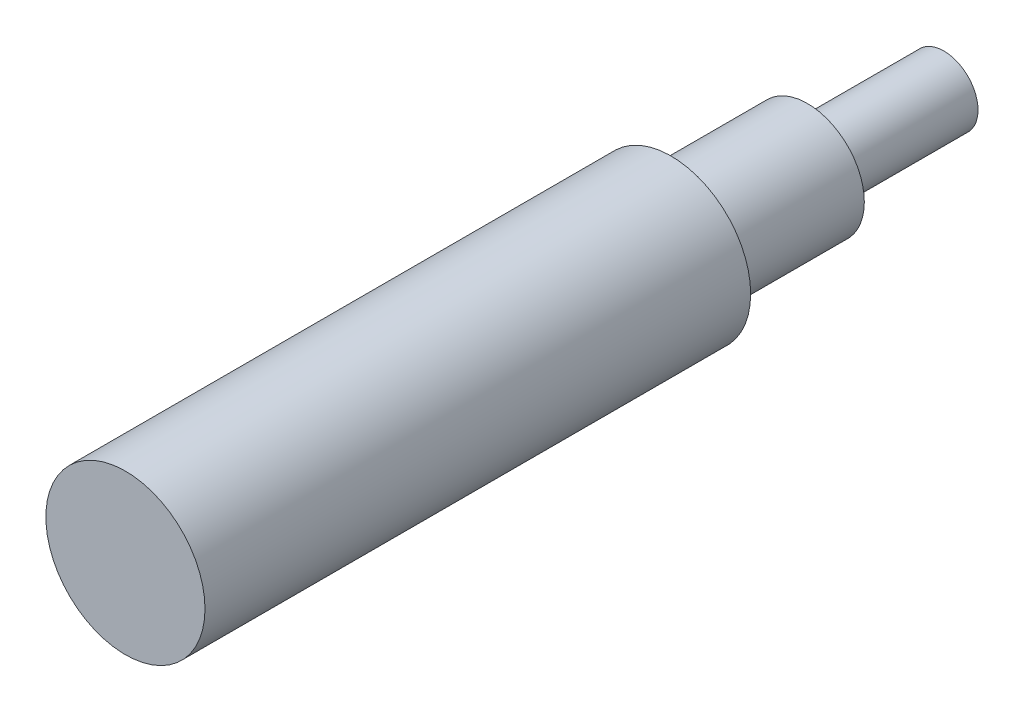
ISO-10303-21;
HEADER;
FILE_DESCRIPTION(('STEP AP214'),'2;1');
FILE_NAME('part.step','',(''),(''),'','','');
FILE_SCHEMA(('AUTOMOTIVE_DESIGN { 1 0 10303 214 1 1 1 1 }'));
ENDSEC;
DATA;
#1=APPLICATION_CONTEXT('core data for automotive mechanical design processes');
#2=APPLICATION_PROTOCOL_DEFINITION('international standard','automotive_design',2000,#1);
#3=PRODUCT_CONTEXT('',#1,'mechanical');
#4=PRODUCT('Part','Part','',(#3));
#5=PRODUCT_RELATED_PRODUCT_CATEGORY('part','',(#4));
#6=PRODUCT_DEFINITION_FORMATION('','',#4);
#7=PRODUCT_DEFINITION_CONTEXT('part definition',#1,'design');
#8=PRODUCT_DEFINITION('design','',#6,#7);
#9=PRODUCT_DEFINITION_SHAPE('','',#8);
#10=(LENGTH_UNIT() NAMED_UNIT(*) SI_UNIT(.MILLI.,.METRE.));
#11=(NAMED_UNIT(*) PLANE_ANGLE_UNIT() SI_UNIT($,.RADIAN.));
#12=(NAMED_UNIT(*) SI_UNIT($,.STERADIAN.) SOLID_ANGLE_UNIT());
#13=UNCERTAINTY_MEASURE_WITH_UNIT(LENGTH_MEASURE(1.E-05),#10,'distance_accuracy_value','');
#14=(GEOMETRIC_REPRESENTATION_CONTEXT(3) GLOBAL_UNCERTAINTY_ASSIGNED_CONTEXT((#13)) GLOBAL_UNIT_ASSIGNED_CONTEXT((#10,
#11,#12)) REPRESENTATION_CONTEXT('',''));
#15=CARTESIAN_POINT('',(0.,0.,0.));
#16=DIRECTION('',(0.,0.,1.));
#17=DIRECTION('',(1.,0.,0.));
#18=AXIS2_PLACEMENT_3D('',#15,#16,#17);
#19=CARTESIAN_POINT('',(0.,0.,150.));
#20=DIRECTION('',(0.,0.,-1.));
#21=DIRECTION('',(-1.,0.,0.));
#22=AXIS2_PLACEMENT_3D('',#19,#20,#21);
#23=CYLINDRICAL_SURFACE('',#22,12.5);
#24=CARTESIAN_POINT('',(0.,0.,0.));
#25=DIRECTION('',(0.,0.,1.));
#26=DIRECTION('',(1.,0.,0.));
#27=AXIS2_PLACEMENT_3D('',#24,#25,#26);
#28=CIRCLE('',#27,12.5);
#29=CARTESIAN_POINT('',(12.5,0.,0.));
#30=VERTEX_POINT('',#29);
#31=EDGE_CURVE('E38',#30,#30,#28,.T.);
#32=ORIENTED_EDGE('',*,*,#31,.T.);
#33=EDGE_LOOP('',(#32));
#34=FACE_BOUND('',#33,.T.);
#35=CARTESIAN_POINT('',(0.,0.,30.));
#36=DIRECTION('',(0.,0.,1.));
#37=DIRECTION('',(1.,0.,0.));
#38=AXIS2_PLACEMENT_3D('',#35,#36,#37);
#39=CIRCLE('',#38,12.5);
#40=CARTESIAN_POINT('',(12.5,0.,30.));
#41=VERTEX_POINT('',#40);
#42=EDGE_CURVE('E10',#41,#41,#39,.T.);
#43=ORIENTED_EDGE('',*,*,#42,.F.);
#44=EDGE_LOOP('',(#43));
#45=FACE_BOUND('',#44,.T.);
#46=ADVANCED_FACE('F28',(#34,#45),#23,.T.);
#47=CARTESIAN_POINT('',(0.,0.,0.));
#48=DIRECTION('',(0.,0.,1.));
#49=DIRECTION('',(1.,0.,0.));
#50=AXIS2_PLACEMENT_3D('',#47,#48,#49);
#51=PLANE('',#50);
#52=ORIENTED_EDGE('',*,*,#31,.F.);
#53=EDGE_LOOP('',(#52));
#54=FACE_BOUND('',#53,.T.);
#55=CARTESIAN_POINT('',(0.,0.,0.));
#56=DIRECTION('',(0.,0.,1.));
#57=DIRECTION('',(1.,0.,0.));
#58=AXIS2_PLACEMENT_3D('',#55,#56,#57);
#59=CIRCLE('',#58,7.5);
#60=CARTESIAN_POINT('',(7.5,0.,0.));
#61=VERTEX_POINT('',#60);
#62=EDGE_CURVE('E34',#61,#61,#59,.F.);
#63=ORIENTED_EDGE('',*,*,#62,.F.);
#64=EDGE_LOOP('',(#63));
#65=FACE_BOUND('',#64,.T.);
#66=ADVANCED_FACE('F78',(#54,#65),#51,.F.);
#67=CARTESIAN_POINT('',(0.,0.,-30.));
#68=DIRECTION('',(0.,0.,1.));
#69=DIRECTION('',(1.,0.,0.));
#70=AXIS2_PLACEMENT_3D('',#67,#68,#69);
#71=CYLINDRICAL_SURFACE('',#70,7.5);
#72=CARTESIAN_POINT('',(0.,0.,-30.));
#73=DIRECTION('',(0.,0.,-1.));
#74=DIRECTION('',(-1.,0.,0.));
#75=AXIS2_PLACEMENT_3D('',#72,#73,#74);
#76=CIRCLE('',#75,7.5);
#77=CARTESIAN_POINT('',(-7.5,0.,-30.));
#78=VERTEX_POINT('',#77);
#79=EDGE_CURVE('E42',#78,#78,#76,.T.);
#80=ORIENTED_EDGE('',*,*,#79,.F.);
#81=EDGE_LOOP('',(#80));
#82=FACE_BOUND('',#81,.T.);
#83=ORIENTED_EDGE('',*,*,#62,.T.);
#84=EDGE_LOOP('',(#83));
#85=FACE_BOUND('',#84,.T.);
#86=ADVANCED_FACE('F84',(#82,#85),#71,.T.);
#87=CARTESIAN_POINT('',(0.,0.,-30.));
#88=DIRECTION('',(0.,0.,-1.));
#89=DIRECTION('',(-1.,0.,0.));
#90=AXIS2_PLACEMENT_3D('',#87,#88,#89);
#91=PLANE('',#90);
#92=CARTESIAN_POINT('',(0.,0.,-30.));
#93=DIRECTION('',(0.,0.,-1.));
#94=DIRECTION('',(-1.,0.,0.));
#95=AXIS2_PLACEMENT_3D('',#92,#93,#94);
#96=CIRCLE('',#95,6.);
#97=CARTESIAN_POINT('',(-6.,0.,-30.));
#98=VERTEX_POINT('',#97);
#99=EDGE_CURVE('E48',#98,#98,#96,.T.);
#100=ORIENTED_EDGE('',*,*,#99,.F.);
#101=EDGE_LOOP('',(#100));
#102=FACE_BOUND('',#101,.T.);
#103=ORIENTED_EDGE('',*,*,#79,.T.);
#104=EDGE_LOOP('',(#103));
#105=FACE_BOUND('',#104,.T.);
#106=ADVANCED_FACE('F92',(#102,#105),#91,.T.);
#107=CARTESIAN_POINT('',(0.,0.,0.));
#108=DIRECTION('',(0.,0.,-1.));
#109=DIRECTION('',(-1.,0.,0.));
#110=AXIS2_PLACEMENT_3D('',#107,#108,#109);
#111=CYLINDRICAL_SURFACE('',#110,6.);
#112=CARTESIAN_POINT('',(0.,0.,0.));
#113=DIRECTION('',(0.,0.,-1.));
#114=DIRECTION('',(-1.,0.,0.));
#115=AXIS2_PLACEMENT_3D('',#112,#113,#114);
#116=CIRCLE('',#115,6.);
#117=CARTESIAN_POINT('',(-6.,0.,0.));
#118=VERTEX_POINT('',#117);
#119=EDGE_CURVE('E47',#118,#118,#116,.T.);
#120=ORIENTED_EDGE('',*,*,#119,.F.);
#121=EDGE_LOOP('',(#120));
#122=FACE_BOUND('',#121,.T.);
#123=ORIENTED_EDGE('',*,*,#99,.T.);
#124=EDGE_LOOP('',(#123));
#125=FACE_BOUND('',#124,.T.);
#126=ADVANCED_FACE('F74',(#122,#125),#111,.F.);
#127=CARTESIAN_POINT('',(0.,0.,0.));
#128=DIRECTION('',(0.,0.,-1.));
#129=DIRECTION('',(-1.,0.,0.));
#130=AXIS2_PLACEMENT_3D('',#127,#128,#129);
#131=PLANE('',#130);
#132=ORIENTED_EDGE('',*,*,#119,.T.);
#133=EDGE_LOOP('',(#132));
#134=FACE_BOUND('',#133,.T.);
#135=ADVANCED_FACE('F65',(#134),#131,.T.);
#136=CARTESIAN_POINT('',(0.,0.,30.));
#137=DIRECTION('',(0.,0.,1.));
#138=DIRECTION('',(1.,0.,0.));
#139=AXIS2_PLACEMENT_3D('',#136,#137,#138);
#140=PLANE('',#139);
#141=CARTESIAN_POINT('',(0.,0.,30.));
#142=DIRECTION('',(0.,0.,1.));
#143=DIRECTION('',(1.,0.,0.));
#144=AXIS2_PLACEMENT_3D('',#141,#142,#143);
#145=CIRCLE('',#144,17.5);
#146=CARTESIAN_POINT('',(17.5,0.,30.));
#147=VERTEX_POINT('',#146);
#148=EDGE_CURVE('E51',#147,#147,#145,.T.);
#149=ORIENTED_EDGE('',*,*,#148,.F.);
#150=EDGE_LOOP('',(#149));
#151=FACE_BOUND('',#150,.T.);
#152=ORIENTED_EDGE('',*,*,#42,.T.);
#153=EDGE_LOOP('',(#152));
#154=FACE_BOUND('',#153,.T.);
#155=ADVANCED_FACE('F63',(#151,#154),#140,.F.);
#156=CARTESIAN_POINT('',(0.,0.,30.));
#157=DIRECTION('',(0.,0.,1.));
#158=DIRECTION('',(1.,0.,0.));
#159=AXIS2_PLACEMENT_3D('',#156,#157,#158);
#160=CYLINDRICAL_SURFACE('',#159,17.5);
#161=ORIENTED_EDGE('',*,*,#148,.T.);
#162=EDGE_LOOP('',(#161));
#163=FACE_BOUND('',#162,.T.);
#164=CARTESIAN_POINT('',(0.,0.,150.));
#165=DIRECTION('',(0.,0.,1.));
#166=DIRECTION('',(1.,0.,0.));
#167=AXIS2_PLACEMENT_3D('',#164,#165,#166);
#168=CIRCLE('',#167,17.5);
#169=CARTESIAN_POINT('',(17.5,0.,150.));
#170=VERTEX_POINT('',#169);
#171=EDGE_CURVE('E54',#170,#170,#168,.T.);
#172=ORIENTED_EDGE('',*,*,#171,.F.);
#173=EDGE_LOOP('',(#172));
#174=FACE_BOUND('',#173,.T.);
#175=ADVANCED_FACE('F60',(#163,#174),#160,.T.);
#176=CARTESIAN_POINT('',(0.,0.,150.));
#177=DIRECTION('',(0.,0.,1.));
#178=DIRECTION('',(1.,0.,0.));
#179=AXIS2_PLACEMENT_3D('',#176,#177,#178);
#180=PLANE('',#179);
#181=ORIENTED_EDGE('',*,*,#171,.T.);
#182=EDGE_LOOP('',(#181));
#183=FACE_BOUND('',#182,.T.);
#184=ADVANCED_FACE('F71',(#183),#180,.T.);
#185=CLOSED_SHELL('',(#46,#66,#86,#106,#126,#135,#155,#175,#184));
#186=MANIFOLD_SOLID_BREP('B2',#185);
#187=ADVANCED_BREP_SHAPE_REPRESENTATION('',(#18,#186),#14);
#188=SHAPE_DEFINITION_REPRESENTATION(#9,#187);
ENDSEC;
END-ISO-10303-21;
